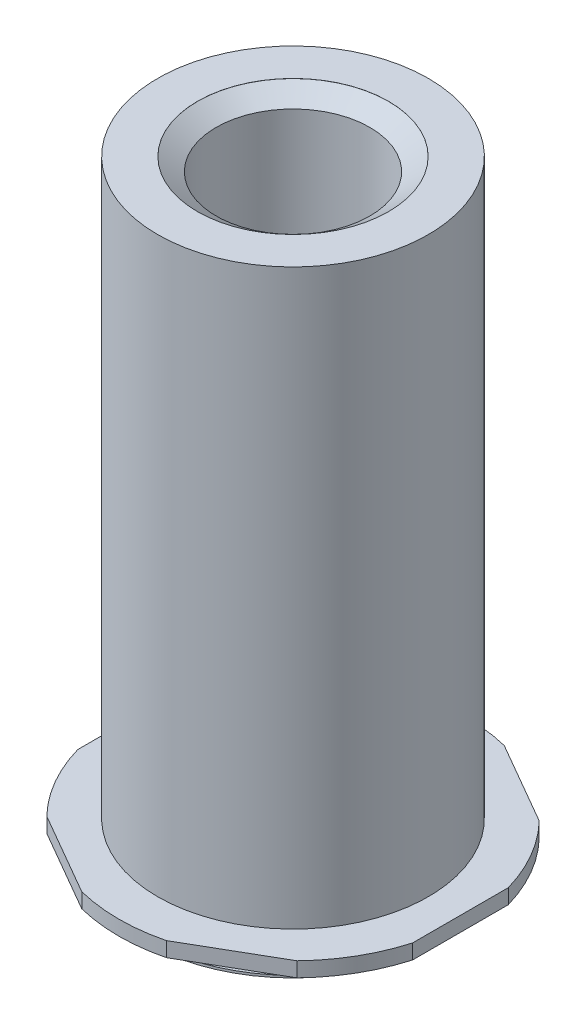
from build123d import *

# Parameters (mm, degrees)
HEXDIESKE_R  = 6.465316
HEXDIE_DEPTH = 0.49149


with BuildPart() as part:
    # BodySke → Body (revolve)
    with BuildSketch(Plane.XY, mode=Mode.PRIVATE) as body_sk:
        Polygon((4.732061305, 0), (5.785104, 0), (5.785104, 0.49149), (4.4958, 0.49149), (4.4958, 19.54149), (2.5527, 19.54149), (2.5527, 10.01649), (0, 10.01649), (0, -0.60071), (4.9403, -0.60071), (4.9403, -0.52451), (4.732061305, -0.16383), align=None)
    revolve(body_sk.sketch.rotate(Axis((0, 0, 0), (0, 1, 0)), 90), axis=Axis((0, 0, 0), (0, 1, 0)))

    # TapDriSke → TapDrill (revolve, cut)
    with BuildSketch(Plane.XY, mode=Mode.PRIVATE) as tapdrill_sk:
        Polygon((2.5527, 3.66649), (2.5527, 19.54149), (0, 19.54149), (0, 2.609127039), align=None)
    revolve(tapdrill_sk.sketch.rotate(Axis((0, 0, 0), (0, 1, 0)), 90), axis=Axis((0, 0, 0), (0, 1, 0)), mode=Mode.SUBTRACT)

    # EndChamferSke → EndChamfer (revolve, cut)
    with BuildSketch(Plane.XY, mode=Mode.PRIVATE) as endchamfer_sk:
        Polygon((3.175, 19.53895), (2.5527, 19.103372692), (2.5527, 19.79549), (3.175, 19.79549), align=None)
    revolve(endchamfer_sk.sketch.rotate(Axis((0, -2.54, 0), (0, 1, 0)), 90), axis=Axis((0, -2.54, 0), (0, 1, 0)), mode=Mode.SUBTRACT)

    # HexDieSke → HexDie (cut)
    with BuildSketch(Plane(origin=(0, 0.49149, 0), x_dir=(-1, 0, 0), z_dir=(0, 1, 0))):
        Circle(HEXDIESKE_R)
        Polygon((0, 6.423137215), (5.5626, 3.211568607), (5.5626, -3.211568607), (0, -6.423137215), (-5.5626, -3.211568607), (-5.5626, 3.211568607), align=None, mode=Mode.SUBTRACT)
    extrude(amount=-HEXDIE_DEPTH, mode=Mode.SUBTRACT)


solid = part.part
